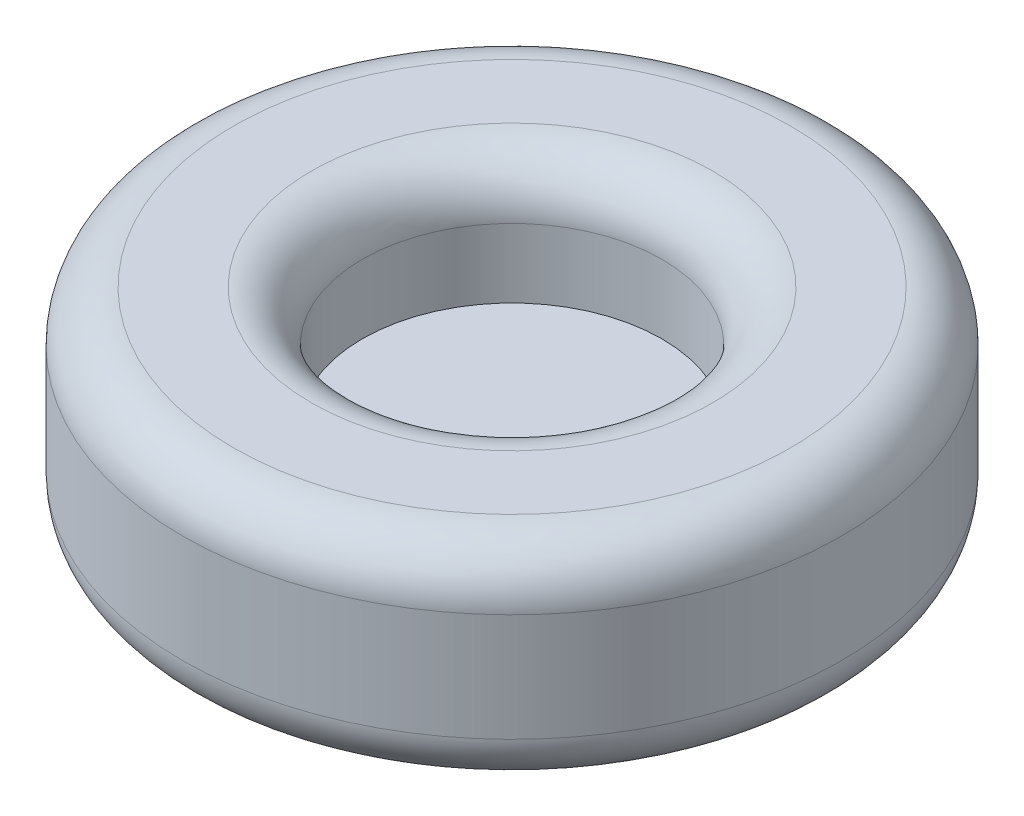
from build123d import *

# Parameters (mm, degrees)
BOSS_EXTRUDE1_DEPTH      = 101.6
BOSS_EXTRUDE1_DEPTH_BACK = 76.2
SKETCH1_R                = 279.4
FILLET1_R                = 43.18
SKETCH2_R                = 127
CUT_EXTRUDE1_DEPTH       = 101.6
FILLET2_R                = 43.18


with BuildPart() as part:
    # Sketch1 → Boss-Extrude1 (new, two sides: drawn at the far end of the back side and taken through both)
    with BuildSketch(Plane(origin=(0, 0, 0), x_dir=(1, 0, 0), z_dir=(0, 1, 0)).offset(-BOSS_EXTRUDE1_DEPTH_BACK)):
        with Locations(Location((0, 0, 0), (0, 0, 270))):
            Circle(SKETCH1_R)
    extrude(amount=BOSS_EXTRUDE1_DEPTH + BOSS_EXTRUDE1_DEPTH_BACK)

    # Fillet1
    fillet1_edges = [part.edges().sort_by_distance(p)[0] for p in [
        (0, -76.2, -279.4),
        (0, 101.6, -279.4),
    ]]
    fillet(fillet1_edges, radius=FILLET1_R)

    # Sketch2 → Cut-Extrude1 (cut)
    with BuildSketch(Plane(origin=(0, 101.6, 0), x_dir=(1, 0, 0), z_dir=(0, 1, 0))):
        with Locations(Location((0, 0, 0), (0, 0, 270))):
            Circle(SKETCH2_R)
    extrude(amount=-CUT_EXTRUDE1_DEPTH, mode=Mode.SUBTRACT)

    # Fillet2
    fillet2_edges = [part.edges().sort_by_distance(p)[0] for p in [
        (0, 101.6, -127),
    ]]
    fillet(fillet2_edges, radius=FILLET2_R)


solid = part.part
